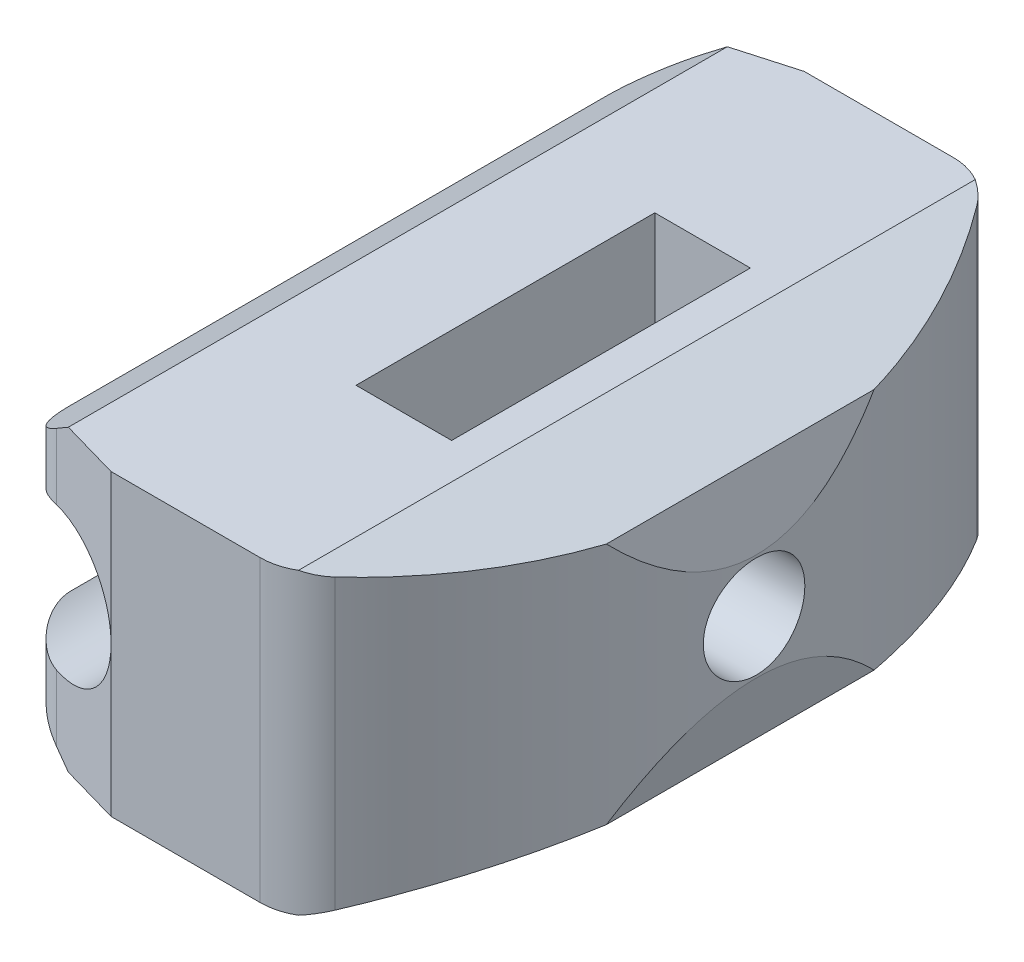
from build123d import *

# Parameters (mm, degrees)
EXTRUSION1_DEPTH             = 58
ESQUISSE2_OUTSIDE_W          = 51.442
ESQUISSE2_OUTSIDE_H          = 74.442
ESQUISSE2_OUTSIDE_W_2        = 8
ESQUISSE2_OUTSIDE_H_2        = 25
ENL_V_MAT_EXTRU_1_DEPTH      = 58
ENL_V_MAT_EXTRU_2_REACH      = 68.88
ENL_V_MAT_EXTRU_2_END_RADIUS = 47.05
ESQUISSE3_R                  = 4.25


with BuildPart() as part:
    # Esquisse1 → Extrusion1 (new body)
    with BuildSketch(Plane.XY):
        with BuildLine():
            Line((10, 25), (30, 25))
            Line((30, 25), (38.647556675, 22.66939931))
            Line((38.647556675, 22.66939931), (40, 16.957556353))
            Line((40, 16.957556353), (40, 8.042443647))
            Line((40, 8.042443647), (38.647556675, 2.33060069))
            Line((38.647556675, 2.33060069), (30, 0))
            Line((30, 0), (10, 0))
            Line((10, 0), (5, 3.507651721))
            Line((5, 3.507651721), (5, 8.027864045))
            ThreePointArc((5, 8.027864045), (15, 12.5), (5, 16.972135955))
            Line((5, 16.972135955), (5, 21.492348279))
            Line((5, 21.492348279), (10, 25))
        make_face()
    extrude(amount=-EXTRUSION1_DEPTH)

    # Esquisse2 outside → Enl_v. mat.-Extru.1 (cut)
    # profile 1 of 2: a face of its own
    with BuildSketch(Plane(origin=(0, 0, 0), x_dir=(1, 0, 0), z_dir=(0, 1, 0))):
        with Locations((22.5, 29)):
            Rectangle(ESQUISSE2_OUTSIDE_W, ESQUISSE2_OUTSIDE_H)
        with BuildLine():
            Line((15, 58), (8.628512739, 56.182611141))
            ThreePointArc((8.628512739, 56.182611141), (6.008920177, 54.386243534), (5, 51.374386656))
            Line((5, 51.374386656), (5, 6.625613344))
            ThreePointArc((5, 6.625613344), (6.008920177, 3.613756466), (8.628512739, 1.817388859))
            Line((8.628512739, 1.817388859), (15, 0))
            Line((15, 0), (27.478285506, 0))
            ThreePointArc((27.478285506, 0), (29.794669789, 0.568931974), (31.58390804, 2.146254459))
            ThreePointArc((31.58390804, 2.146254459), (40, 29), (31.58390804, 55.853745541))
            ThreePointArc((31.58390804, 55.853745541), (29.794669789, 57.431068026), (27.478285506, 58))
            Line((27.478285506, 58), (15, 58))
        make_face(mode=Mode.SUBTRACT)
    # profile 2 of 2: a face of its own
    with BuildSketch(Plane(origin=(0, 0, 0), x_dir=(1, 0, 0), z_dir=(0, 1, 0))):
        with Locations((23, 29)):
            Rectangle(ESQUISSE2_OUTSIDE_W_2, ESQUISSE2_OUTSIDE_H_2)
    extrude(amount=ENL_V_MAT_EXTRU_1_DEPTH, mode=Mode.SUBTRACT)

    # Enl_v. mat.-Extru.2: up to this cylinder (the profile starts inside it)
    enl_v_mat_extru_2_end = Plane(origin=(-7.05, 12.5, -29), z_dir=(0, -1, 0)) * Cylinder(ENL_V_MAT_EXTRU_2_END_RADIUS, 232.86, mode=Mode.PRIVATE)
    # Esquisse3 → Enl_v. mat.-Extru.2 (cut, up to the surface)
    with BuildSketch(Plane.ZY.offset(-27), mode=Mode.PRIVATE) as enl_v_mat_extru_2_sk1:
        with Locations(Location((-29, 12.5, 0), (0, 0, 270))):
            Circle(ESQUISSE3_R)
    enl_v_mat_extru_2_tool1 = extrude(enl_v_mat_extru_2_sk1.sketch, amount=-ENL_V_MAT_EXTRU_2_REACH, mode=Mode.PRIVATE) & enl_v_mat_extru_2_end
    add(enl_v_mat_extru_2_tool1.solids().sort_by_distance((27, 12.5, -29))[0], mode=Mode.SUBTRACT)


solid = part.part
